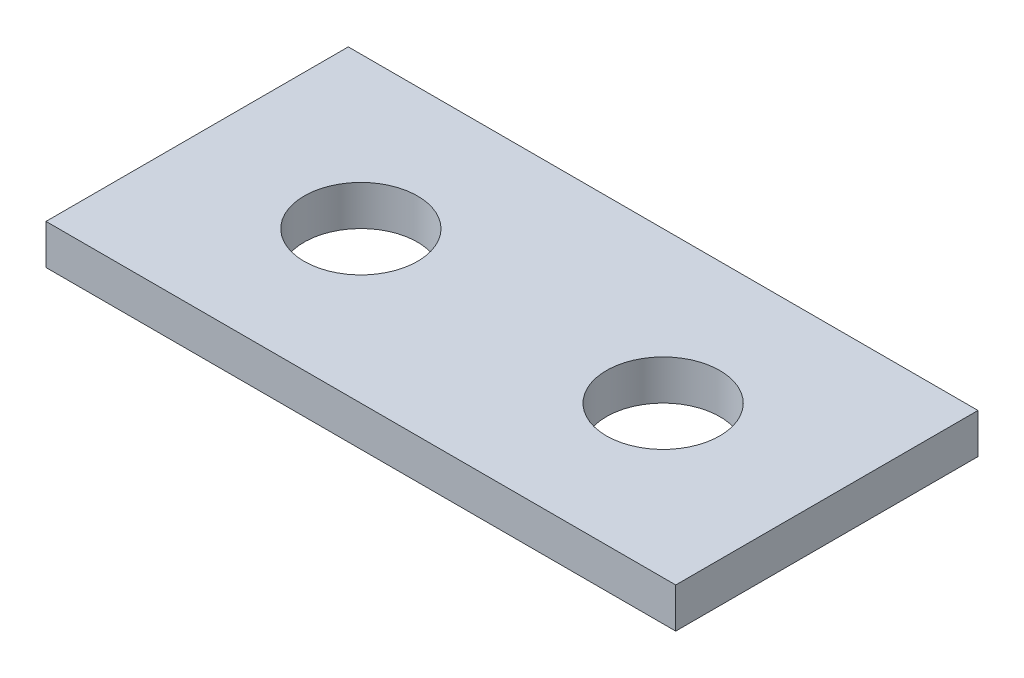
from build123d import *

# Parameters (mm, degrees)
SKETCH1_W            = 50
SKETCH1_H            = 24
EXTRUDE1_DEPTH       = 3.175
M8_CLEARANCE_HOLE1_D = 9


with BuildPart() as part:
    # Sketch1 → Extrude1 (new body)
    with BuildSketch(Plane(origin=(0, 0, 0), x_dir=(1, 0, 0), z_dir=(0, 1, 0))):
        Rectangle(SKETCH1_W, SKETCH1_H)
    extrude(amount=EXTRUDE1_DEPTH)

    # M8 Clearance Hole1 (through all)
    with Locations(Plane(origin=(-12, 3.175, 0), x_dir=(0, 0, 1), z_dir=(0, 1, 0))):
        with Locations((0, 0)):
            m8_clearance_hole1 = Hole(M8_CLEARANCE_HOLE1_D / 2)

    # Mirror1: M8 Clearance Hole1 across plane
    add(m8_clearance_hole1.mirror(Plane(origin=(0, 0, 0), x_dir=(0, 0, 1), z_dir=(1, 0, 0))), mode=Mode.SUBTRACT)


solid = part.part
